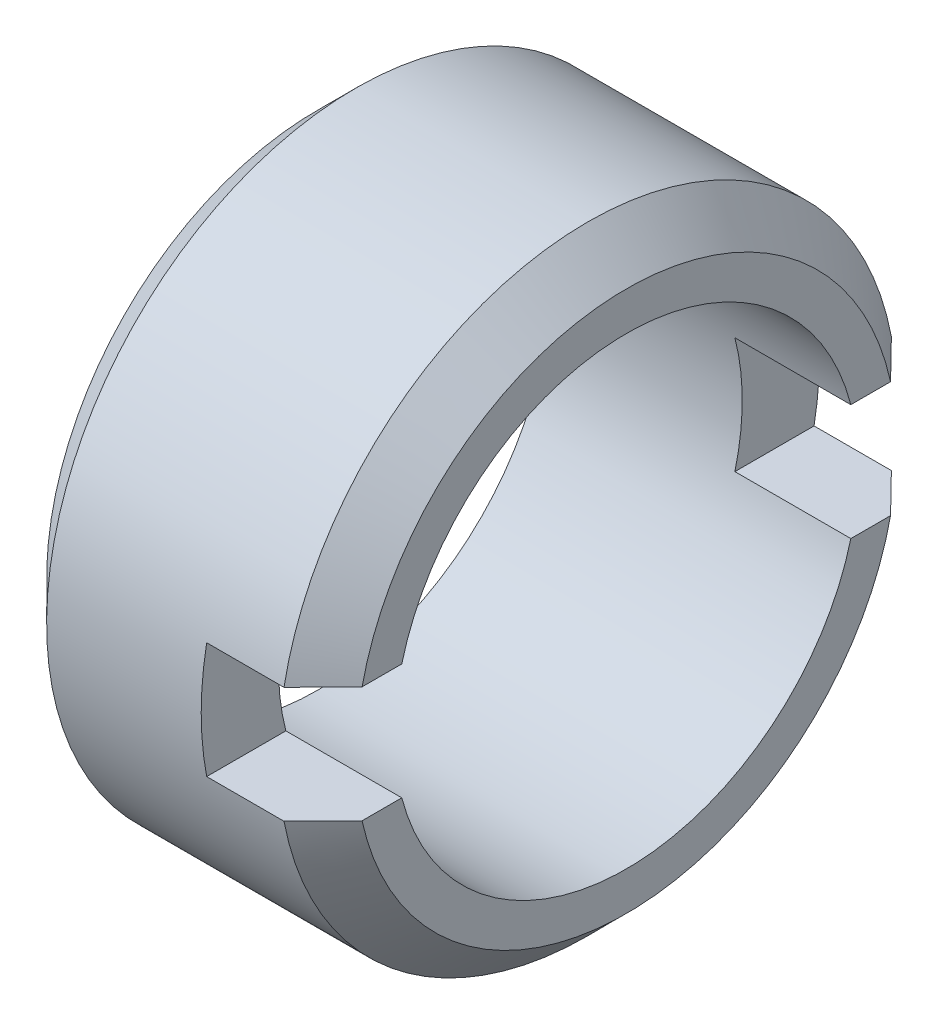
ISO-10303-21;
HEADER;
FILE_DESCRIPTION(('STEP AP214'),'2;1');
FILE_NAME('part.step','',(''),(''),'','','');
FILE_SCHEMA(('AUTOMOTIVE_DESIGN { 1 0 10303 214 1 1 1 1 }'));
ENDSEC;
DATA;
#1=APPLICATION_CONTEXT('core data for automotive mechanical design processes');
#2=APPLICATION_PROTOCOL_DEFINITION('international standard','automotive_design',2000,#1);
#3=PRODUCT_CONTEXT('',#1,'mechanical');
#4=PRODUCT('Part','Part','',(#3));
#5=PRODUCT_RELATED_PRODUCT_CATEGORY('part','',(#4));
#6=PRODUCT_DEFINITION_FORMATION('','',#4);
#7=PRODUCT_DEFINITION_CONTEXT('part definition',#1,'design');
#8=PRODUCT_DEFINITION('design','',#6,#7);
#9=PRODUCT_DEFINITION_SHAPE('','',#8);
#10=(LENGTH_UNIT() NAMED_UNIT(*) SI_UNIT(.MILLI.,.METRE.));
#11=(NAMED_UNIT(*) PLANE_ANGLE_UNIT() SI_UNIT($,.RADIAN.));
#12=(NAMED_UNIT(*) SI_UNIT($,.STERADIAN.) SOLID_ANGLE_UNIT());
#13=UNCERTAINTY_MEASURE_WITH_UNIT(LENGTH_MEASURE(1.E-05),#10,'distance_accuracy_value','');
#14=(GEOMETRIC_REPRESENTATION_CONTEXT(3) GLOBAL_UNCERTAINTY_ASSIGNED_CONTEXT((#13)) GLOBAL_UNIT_ASSIGNED_CONTEXT((#10,
#11,#12)) REPRESENTATION_CONTEXT('',''));
#15=CARTESIAN_POINT('',(0.,0.,0.));
#16=DIRECTION('',(0.,0.,1.));
#17=DIRECTION('',(1.,0.,0.));
#18=AXIS2_PLACEMENT_3D('',#15,#16,#17);
#19=CARTESIAN_POINT('',(8.,0.,0.));
#20=DIRECTION('',(1.,0.,0.));
#21=DIRECTION('',(0.,0.,-1.));
#22=AXIS2_PLACEMENT_3D('',#19,#20,#21);
#23=PLANE('',#22);
#24=CARTESIAN_POINT('',(8.,0.,0.));
#25=DIRECTION('',(1.,0.,0.));
#26=DIRECTION('',(0.,0.,-1.));
#27=AXIS2_PLACEMENT_3D('',#24,#25,#26);
#28=CIRCLE('',#27,7.);
#29=CARTESIAN_POINT('',(8.,1.5,-6.83739716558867));
#30=VERTEX_POINT('',#29);
#31=CARTESIAN_POINT('',(8.,1.5,6.83739716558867));
#32=VERTEX_POINT('',#31);
#33=EDGE_CURVE('E183',#30,#32,#28,.T.);
#34=ORIENTED_EDGE('',*,*,#33,.T.);
#35=DIRECTION('',(0.,0.,-1.));
#36=VECTOR('',#35,1.);
#37=CARTESIAN_POINT('',(8.,1.5,0.));
#38=LINE('',#37,#36);
#39=CARTESIAN_POINT('',(8.,1.5,5.80947501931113));
#40=VERTEX_POINT('',#39);
#41=EDGE_CURVE('E159',#32,#40,#38,.T.);
#42=ORIENTED_EDGE('',*,*,#41,.T.);
#43=CARTESIAN_POINT('',(8.,0.,0.));
#44=DIRECTION('',(1.,0.,0.));
#45=DIRECTION('',(0.,0.,-1.));
#46=AXIS2_PLACEMENT_3D('',#43,#44,#45);
#47=CIRCLE('',#46,6.);
#48=CARTESIAN_POINT('',(8.,1.5,-5.80947501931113));
#49=VERTEX_POINT('',#48);
#50=EDGE_CURVE('E167',#49,#40,#47,.T.);
#51=ORIENTED_EDGE('',*,*,#50,.F.);
#52=EDGE_CURVE('E155',#49,#30,#38,.T.);
#53=ORIENTED_EDGE('',*,*,#52,.T.);
#54=EDGE_LOOP('',(#34,#42,#51,#53));
#55=FACE_BOUND('',#54,.T.);
#56=ADVANCED_FACE('F37',(#55),#23,.T.);
#57=CARTESIAN_POINT('',(8.,-1.5,6.83739716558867));
#58=VERTEX_POINT('',#57);
#59=CARTESIAN_POINT('',(8.,-1.5,-6.83739716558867));
#60=VERTEX_POINT('',#59);
#61=EDGE_CURVE('E182',#58,#60,#28,.T.);
#62=ORIENTED_EDGE('',*,*,#61,.T.);
#63=DIRECTION('',(0.,0.,1.));
#64=VECTOR('',#63,1.);
#65=CARTESIAN_POINT('',(8.,-1.5,0.));
#66=LINE('',#65,#64);
#67=CARTESIAN_POINT('',(8.,-1.5,-5.80947501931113));
#68=VERTEX_POINT('',#67);
#69=EDGE_CURVE('E53',#60,#68,#66,.T.);
#70=ORIENTED_EDGE('',*,*,#69,.T.);
#71=CARTESIAN_POINT('',(8.,-1.5,5.80947501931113));
#72=VERTEX_POINT('',#71);
#73=EDGE_CURVE('E171',#72,#68,#47,.T.);
#74=ORIENTED_EDGE('',*,*,#73,.F.);
#75=EDGE_CURVE('E140',#72,#58,#66,.T.);
#76=ORIENTED_EDGE('',*,*,#75,.T.);
#77=EDGE_LOOP('',(#62,#70,#74,#76));
#78=FACE_BOUND('',#77,.T.);
#79=ADVANCED_FACE('F216',(#78),#23,.T.);
#80=CARTESIAN_POINT('',(8.,0.,0.));
#81=DIRECTION('',(-1.,0.,0.));
#82=DIRECTION('',(0.,0.,1.));
#83=AXIS2_PLACEMENT_3D('',#80,#81,#82);
#84=CYLINDRICAL_SURFACE('',#83,8.);
#85=CARTESIAN_POINT('',(1.,0.,0.));
#86=DIRECTION('',(1.,0.,0.));
#87=DIRECTION('',(0.,0.,-1.));
#88=AXIS2_PLACEMENT_3D('',#85,#86,#87);
#89=CIRCLE('',#88,8.);
#90=CARTESIAN_POINT('',(1.,0.,-8.));
#91=VERTEX_POINT('',#90);
#92=EDGE_CURVE('E176',#91,#91,#89,.T.);
#93=ORIENTED_EDGE('',*,*,#92,.T.);
#94=EDGE_LOOP('',(#93));
#95=FACE_BOUND('',#94,.T.);
#96=DIRECTION('',(-1.,0.,0.));
#97=VECTOR('',#96,1.);
#98=CARTESIAN_POINT('',(8.,1.5,-7.85811682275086));
#99=LINE('',#98,#97);
#100=CARTESIAN_POINT('',(5.,1.5,-7.85811682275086));
#101=VERTEX_POINT('',#100);
#102=CARTESIAN_POINT('',(7.,1.5,-7.85811682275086));
#103=VERTEX_POINT('',#102);
#104=EDGE_CURVE('E153',#101,#103,#99,.F.);
#105=ORIENTED_EDGE('',*,*,#104,.F.);
#106=CARTESIAN_POINT('',(5.,0.,0.));
#107=DIRECTION('',(1.,0.,0.));
#108=DIRECTION('',(0.,0.,-1.));
#109=AXIS2_PLACEMENT_3D('',#106,#107,#108);
#110=CIRCLE('',#109,8.);
#111=CARTESIAN_POINT('',(5.,-1.5,-7.85811682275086));
#112=VERTEX_POINT('',#111);
#113=EDGE_CURVE('E126',#112,#101,#110,.T.);
#114=ORIENTED_EDGE('',*,*,#113,.F.);
#115=DIRECTION('',(-1.,0.,0.));
#116=VECTOR('',#115,1.);
#117=CARTESIAN_POINT('',(8.,-1.5,-7.85811682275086));
#118=LINE('',#117,#116);
#119=CARTESIAN_POINT('',(7.,-1.5,-7.85811682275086));
#120=VERTEX_POINT('',#119);
#121=EDGE_CURVE('E147',#120,#112,#118,.T.);
#122=ORIENTED_EDGE('',*,*,#121,.F.);
#123=CARTESIAN_POINT('',(7.,0.,0.));
#124=DIRECTION('',(1.,0.,0.));
#125=DIRECTION('',(0.,0.,-1.));
#126=AXIS2_PLACEMENT_3D('',#123,#124,#125);
#127=CIRCLE('',#126,8.);
#128=CARTESIAN_POINT('',(7.,-1.5,7.85811682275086));
#129=VERTEX_POINT('',#128);
#130=EDGE_CURVE('E139',#120,#129,#127,.F.);
#131=ORIENTED_EDGE('',*,*,#130,.T.);
#132=DIRECTION('',(-1.,0.,0.));
#133=VECTOR('',#132,1.);
#134=CARTESIAN_POINT('',(8.,-1.5,7.85811682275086));
#135=LINE('',#134,#133);
#136=CARTESIAN_POINT('',(5.,-1.5,7.85811682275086));
#137=VERTEX_POINT('',#136);
#138=EDGE_CURVE('E61',#137,#129,#135,.F.);
#139=ORIENTED_EDGE('',*,*,#138,.F.);
#140=CARTESIAN_POINT('',(5.,1.5,7.85811682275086));
#141=VERTEX_POINT('',#140);
#142=EDGE_CURVE('E117',#141,#137,#110,.T.);
#143=ORIENTED_EDGE('',*,*,#142,.F.);
#144=DIRECTION('',(-1.,0.,0.));
#145=VECTOR('',#144,1.);
#146=CARTESIAN_POINT('',(8.,1.5,7.85811682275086));
#147=LINE('',#146,#145);
#148=CARTESIAN_POINT('',(7.,1.5,7.85811682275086));
#149=VERTEX_POINT('',#148);
#150=EDGE_CURVE('E162',#149,#141,#147,.T.);
#151=ORIENTED_EDGE('',*,*,#150,.F.);
#152=EDGE_CURVE('E170',#149,#103,#127,.F.);
#153=ORIENTED_EDGE('',*,*,#152,.T.);
#154=EDGE_LOOP('',(#105,#114,#122,#131,#139,#143,#151,#153));
#155=FACE_BOUND('',#154,.T.);
#156=ADVANCED_FACE('F136',(#95,#155),#84,.T.);
#157=CARTESIAN_POINT('',(8.,0.,0.));
#158=DIRECTION('',(-1.,0.,0.));
#159=DIRECTION('',(0.,0.,1.));
#160=AXIS2_PLACEMENT_3D('',#157,#158,#159);
#161=CYLINDRICAL_SURFACE('',#160,6.);
#162=CARTESIAN_POINT('',(0.,0.,0.));
#163=DIRECTION('',(1.,0.,0.));
#164=DIRECTION('',(0.,0.,-1.));
#165=AXIS2_PLACEMENT_3D('',#162,#163,#164);
#166=CIRCLE('',#165,6.);
#167=CARTESIAN_POINT('',(0.,0.,-6.));
#168=VERTEX_POINT('',#167);
#169=EDGE_CURVE('E125',#168,#168,#166,.T.);
#170=ORIENTED_EDGE('',*,*,#169,.F.);
#171=EDGE_LOOP('',(#170));
#172=FACE_BOUND('',#171,.T.);
#173=CARTESIAN_POINT('',(5.,0.,0.));
#174=DIRECTION('',(1.,0.,0.));
#175=DIRECTION('',(0.,0.,-1.));
#176=AXIS2_PLACEMENT_3D('',#173,#174,#175);
#177=CIRCLE('',#176,6.);
#178=CARTESIAN_POINT('',(5.,-1.5,-5.80947501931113));
#179=VERTEX_POINT('',#178);
#180=CARTESIAN_POINT('',(5.,1.5,-5.80947501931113));
#181=VERTEX_POINT('',#180);
#182=EDGE_CURVE('E12',#179,#181,#177,.T.);
#183=ORIENTED_EDGE('',*,*,#182,.T.);
#184=DIRECTION('',(-1.,0.,0.));
#185=VECTOR('',#184,1.);
#186=CARTESIAN_POINT('',(8.,1.5,-5.80947501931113));
#187=LINE('',#186,#185);
#188=EDGE_CURVE('E158',#181,#49,#187,.F.);
#189=ORIENTED_EDGE('',*,*,#188,.T.);
#190=ORIENTED_EDGE('',*,*,#50,.T.);
#191=DIRECTION('',(-1.,0.,0.));
#192=VECTOR('',#191,1.);
#193=CARTESIAN_POINT('',(8.,1.5,5.80947501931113));
#194=LINE('',#193,#192);
#195=CARTESIAN_POINT('',(5.,1.5,5.80947501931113));
#196=VERTEX_POINT('',#195);
#197=EDGE_CURVE('E164',#40,#196,#194,.T.);
#198=ORIENTED_EDGE('',*,*,#197,.T.);
#199=CARTESIAN_POINT('',(5.,-1.5,5.80947501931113));
#200=VERTEX_POINT('',#199);
#201=EDGE_CURVE('E42',#196,#200,#177,.T.);
#202=ORIENTED_EDGE('',*,*,#201,.T.);
#203=DIRECTION('',(-1.,0.,0.));
#204=VECTOR('',#203,1.);
#205=CARTESIAN_POINT('',(8.,-1.5,5.80947501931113));
#206=LINE('',#205,#204);
#207=EDGE_CURVE('E130',#200,#72,#206,.F.);
#208=ORIENTED_EDGE('',*,*,#207,.T.);
#209=ORIENTED_EDGE('',*,*,#73,.T.);
#210=DIRECTION('',(-1.,0.,0.));
#211=VECTOR('',#210,1.);
#212=CARTESIAN_POINT('',(8.,-1.5,-5.80947501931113));
#213=LINE('',#212,#211);
#214=EDGE_CURVE('E150',#68,#179,#213,.T.);
#215=ORIENTED_EDGE('',*,*,#214,.T.);
#216=EDGE_LOOP('',(#183,#189,#190,#198,#202,#208,#209,#215));
#217=FACE_BOUND('',#216,.T.);
#218=ADVANCED_FACE('F210',(#172,#217),#161,.F.);
#219=CARTESIAN_POINT('',(8.,0.,0.));
#220=DIRECTION('',(-1.,0.,0.));
#221=DIRECTION('',(0.,0.,1.));
#222=AXIS2_PLACEMENT_3D('',#219,#220,#221);
#223=CONICAL_SURFACE('',#222,7.,0.785398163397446);
#224=ORIENTED_EDGE('',*,*,#152,.F.);
#225=CARTESIAN_POINT('',(-2.61893172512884,1.5,17.5549638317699));
#226=CARTESIAN_POINT('',(-1.99362074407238,1.5,16.9273536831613));
#227=CARTESIAN_POINT('',(-1.3684122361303,1.5,16.2996413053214));
#228=CARTESIAN_POINT('',(-0.118306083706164,1.5,15.0438337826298));
#229=CARTESIAN_POINT('',(0.506591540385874,1.5,14.4157386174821));
#230=CARTESIAN_POINT('',(1.75677601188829,1.5,13.1581762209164));
#231=CARTESIAN_POINT('',(2.3820621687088,1.5,12.5287083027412));
#232=CARTESIAN_POINT('',(3.631832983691,1.5,11.2690484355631));
#233=CARTESIAN_POINT('',(4.25631768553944,1.5,10.6388565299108));
#234=CARTESIAN_POINT('',(5.46666104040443,1.5,9.41501098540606));
#235=CARTESIAN_POINT('',(6.0525928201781,1.5,8.82142974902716));
#236=CARTESIAN_POINT('',(6.93002699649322,1.5,7.929516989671));
#237=CARTESIAN_POINT('',(7.22228623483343,1.5,7.63193023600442));
#238=CARTESIAN_POINT('',(7.8060801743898,1.5,7.03605573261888));
#239=CARTESIAN_POINT('',(8.09761488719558,1.5,6.73776799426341));
#240=CARTESIAN_POINT('',(8.67938833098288,1.5,6.14041681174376));
#241=CARTESIAN_POINT('',(8.96962794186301,1.5,5.84135422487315));
#242=CARTESIAN_POINT('',(9.54851548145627,1.5,5.24165215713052));
#243=CARTESIAN_POINT('',(9.83716330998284,1.5,4.94101257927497));
#244=CARTESIAN_POINT('',(10.2680474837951,1.5,4.48814971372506));
#245=CARTESIAN_POINT('',(10.4113068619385,1.5,4.33690038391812));
#246=CARTESIAN_POINT('',(10.6968959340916,1.5,4.03352717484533));
#247=CARTESIAN_POINT('',(10.8392256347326,1.5,3.88140330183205));
#248=CARTESIAN_POINT('',(11.1225839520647,1.5,3.57597593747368));
#249=CARTESIAN_POINT('',(11.2636126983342,1.5,3.42267256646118));
#250=CARTESIAN_POINT('',(11.5438156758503,1.5,3.1143823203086));
#251=CARTESIAN_POINT('',(11.6829899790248,1.5,2.95939551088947));
#252=CARTESIAN_POINT('',(11.8592298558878,1.5,2.7595022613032));
#253=CARTESIAN_POINT('',(11.8976064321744,1.5,2.7157513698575));
#254=CARTESIAN_POINT('',(11.9741029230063,1.5,2.62802503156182));
#255=CARTESIAN_POINT('',(12.0122228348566,1.5,2.58404958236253));
#256=CARTESIAN_POINT('',(12.1261525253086,1.5,2.4517375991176));
#257=CARTESIAN_POINT('',(12.2015252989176,1.5,2.36302329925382));
#258=CARTESIAN_POINT('',(12.3514863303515,1.5,2.18336896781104));
#259=CARTESIAN_POINT('',(12.426058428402,1.5,2.09241540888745));
#260=CARTESIAN_POINT('',(12.5729942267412,1.5,1.90876870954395));
#261=CARTESIAN_POINT('',(12.6453584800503,1.5,1.81607601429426));
#262=CARTESIAN_POINT('',(12.7877577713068,1.5,1.6272403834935));
#263=CARTESIAN_POINT('',(12.8577568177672,1.5,1.53107015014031));
#264=CARTESIAN_POINT('',(12.9930643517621,1.5,1.33523148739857));
#265=CARTESIAN_POINT('',(13.0583665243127,1.5,1.23555860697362));
#266=CARTESIAN_POINT('',(13.1502815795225,1.5,1.08307902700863));
#267=CARTESIAN_POINT('',(13.1797784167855,1.5,1.03202487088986));
#268=CARTESIAN_POINT('',(13.2363606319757,1.5,0.928602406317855));
#269=CARTESIAN_POINT('',(13.2634455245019,1.5,0.876233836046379));
#270=CARTESIAN_POINT('',(13.3399905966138,1.5,0.717128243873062));
#271=CARTESIAN_POINT('',(13.384962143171,1.5,0.60804173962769));
#272=CARTESIAN_POINT('',(13.4362386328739,1.5,0.444639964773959));
#273=CARTESIAN_POINT('',(13.4502799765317,1.5,0.392746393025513));
#274=CARTESIAN_POINT('',(13.4734842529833,1.5,0.287861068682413));
#275=CARTESIAN_POINT('',(13.4826479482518,1.5,0.234869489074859));
#276=CARTESIAN_POINT('',(13.495427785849,1.5,0.128484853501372));
#277=CARTESIAN_POINT('',(13.4990721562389,1.5,0.075095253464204));
#278=CARTESIAN_POINT('',(13.5006150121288,1.5,-0.0317698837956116));
#279=CARTESIAN_POINT('',(13.4985134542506,1.5,-0.0852454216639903));
#280=CARTESIAN_POINT('',(13.4887554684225,1.5,-0.191428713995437));
#281=CARTESIAN_POINT('',(13.4811244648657,1.5,-0.244138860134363));
#282=CARTESIAN_POINT('',(13.4608799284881,1.5,-0.348598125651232));
#283=CARTESIAN_POINT('',(13.4482641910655,1.5,-0.400346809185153));
#284=CARTESIAN_POINT('',(13.4186934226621,1.5,-0.502955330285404));
#285=CARTESIAN_POINT('',(13.401709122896,1.5,-0.553806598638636));
#286=CARTESIAN_POINT('',(13.3642222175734,1.5,-0.654166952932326));
#287=CARTESIAN_POINT('',(13.3437201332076,1.5,-0.703676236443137));
#288=CARTESIAN_POINT('',(13.2835957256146,1.5,-0.837774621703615));
#289=CARTESIAN_POINT('',(13.2410939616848,1.5,-0.921066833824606));
#290=CARTESIAN_POINT('',(13.150289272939,1.5,-1.08445428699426));
#291=CARTESIAN_POINT('',(13.1019800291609,1.5,-1.16454591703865));
#292=CARTESIAN_POINT('',(13.0012022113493,1.5,-1.32245803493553));
#293=CARTESIAN_POINT('',(12.9487190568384,1.5,-1.40026913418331));
#294=CARTESIAN_POINT('',(12.8409516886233,1.5,-1.55385889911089));
#295=CARTESIAN_POINT('',(12.7856686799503,1.5,-1.6296384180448));
#296=CARTESIAN_POINT('',(12.6725203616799,1.5,-1.78035380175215));
#297=CARTESIAN_POINT('',(12.6146356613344,1.5,-1.85527503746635));
#298=CARTESIAN_POINT('',(12.4973028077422,1.5,-2.00388880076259));
#299=CARTESIAN_POINT('',(12.4378545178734,1.5,-2.07758122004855));
#300=CARTESIAN_POINT('',(12.3179091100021,1.5,-2.22381566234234));
#301=CARTESIAN_POINT('',(12.2574147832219,1.5,-2.29635998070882));
#302=CARTESIAN_POINT('',(12.1355026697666,1.5,-2.4406617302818));
#303=CARTESIAN_POINT('',(12.0740849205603,1.5,-2.51241919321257));
#304=CARTESIAN_POINT('',(11.8913963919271,1.5,-2.7236694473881));
#305=CARTESIAN_POINT('',(11.7690932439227,1.5,-2.86226884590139));
#306=CARTESIAN_POINT('',(11.5226315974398,1.5,-3.13781078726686));
#307=CARTESIAN_POINT('',(11.398473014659,1.5,-3.27475325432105));
#308=CARTESIAN_POINT('',(11.1488351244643,1.5,-3.54746163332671));
#309=CARTESIAN_POINT('',(11.0233556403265,1.5,-3.68322738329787));
#310=CARTESIAN_POINT('',(10.7714444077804,1.5,-3.95387326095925));
#311=CARTESIAN_POINT('',(10.6450126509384,1.5,-4.08875338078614));
#312=CARTESIAN_POINT('',(10.2643618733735,1.5,-4.49271440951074));
#313=CARTESIAN_POINT('',(10.0090828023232,1.5,-4.76079577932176));
#314=CARTESIAN_POINT('',(9.49685589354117,1.5,-5.29531294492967));
#315=CARTESIAN_POINT('',(9.23990819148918,1.5,-5.56174887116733));
#316=CARTESIAN_POINT('',(8.72725848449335,1.5,-6.09110821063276));
#317=CARTESIAN_POINT('',(8.4715666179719,1.5,-6.35404144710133));
#318=CARTESIAN_POINT('',(7.959422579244,1.5,-6.87917638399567));
#319=CARTESIAN_POINT('',(7.70297039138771,1.5,-7.14137806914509));
#320=CARTESIAN_POINT('',(6.93304903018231,1.5,-7.92695755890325));
#321=CARTESIAN_POINT('',(6.4187801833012,1.5,-8.44955141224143));
#322=CARTESIAN_POINT('',(5.55185522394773,1.5,-9.32849249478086));
#323=CARTESIAN_POINT('',(5.19951746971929,1.5,-9.68515423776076));
#324=CARTESIAN_POINT('',(4.49442755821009,1.5,-10.3980693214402));
#325=CARTESIAN_POINT('',(4.14167540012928,1.5,-10.7543226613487));
#326=CARTESIAN_POINT('',(3.0828518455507,1.5,-11.8227561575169));
#327=CARTESIAN_POINT('',(2.37633094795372,1.5,-12.5344907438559));
#328=CARTESIAN_POINT('',(0.955225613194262,1.5,-13.9646767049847));
#329=CARTESIAN_POINT('',(0.240633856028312,1.5,-14.683120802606));
#330=CARTESIAN_POINT('',(-1.18890769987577,1.5,-16.1194059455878));
#331=CARTESIAN_POINT('',(-1.90385741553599,1.5,-16.8372470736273));
#332=CARTESIAN_POINT('',(-2.61893172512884,1.5,-17.5549638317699));
#333=B_SPLINE_CURVE_WITH_KNOTS('',3,(#225,#226,#227,#228,#229,#230,#231,#232,#233,#234,#235,
#236,#237,#238,#239,#240,#241,#242,#243,#244,#245,#246,#247,#248,#249,#250,#251,#252,#253,#254,
#255,#256,#257,#258,#259,#260,#261,#262,#263,#264,#265,#266,#267,#268,#269,#270,#271,#272,#273,
#274,#275,#276,#277,#278,#279,#280,#281,#282,#283,#284,#285,#286,#287,#288,#289,#290,#291,#292,
#293,#294,#295,#296,#297,#298,#299,#300,#301,#302,#303,#304,#305,#306,#307,#308,#309,#310,#311,
#312,#313,#314,#315,#316,#317,#318,#319,#320,#321,#322,#323,#324,#325,#326,#327,#328,#329,#330,
#331,#332),.UNSPECIFIED.,.F.,.F.,(4,2,2,2,2,2,2,2,2,2,2,2,2,2,2,2,2,2,2,2,2,2,2,2,2,2,2,2,2,2,2,
2,2,2,2,2,2,2,2,2,2,2,2,2,2,2,2,2,2,2,2,2,2,4),(0.,2.65785167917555,5.31585929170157,
7.9776089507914,10.6392067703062,13.1413810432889,14.3926836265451,15.6439660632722,
16.8942021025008,18.1445159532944,18.7694905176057,19.3944606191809,20.0193677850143,
20.6442506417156,20.8188410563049,20.9934333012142,21.3426493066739,21.695474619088,
22.0482108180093,22.4049712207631,22.7622026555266,22.9390263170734,23.1158854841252,
23.4683672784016,23.6294601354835,23.7905278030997,23.9507688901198,24.1110111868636,
24.2705213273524,24.4301020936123,24.5907812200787,24.7514365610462,25.0315824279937,
25.3120359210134,25.593516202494,25.8748763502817,26.1588816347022,26.4429118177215,
26.7262749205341,27.0096265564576,27.5641339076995,28.118666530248,28.6732743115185,
29.2278870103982,30.3384194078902,31.4488626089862,32.549137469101,33.6494351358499,
35.8490195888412,37.3530624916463,38.8571083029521,41.8657018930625,44.9056407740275,
47.945055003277),.UNSPECIFIED.);
#334=EDGE_CURVE('E247',#149,#32,#333,.T.);
#335=ORIENTED_EDGE('',*,*,#334,.T.);
#336=ORIENTED_EDGE('',*,*,#33,.F.);
#337=EDGE_CURVE('E192',#30,#103,#333,.T.);
#338=ORIENTED_EDGE('',*,*,#337,.T.);
#339=EDGE_LOOP('',(#224,#335,#336,#338));
#340=FACE_BOUND('',#339,.T.);
#341=ADVANCED_FACE('F39',(#340),#223,.T.);
#342=ORIENTED_EDGE('',*,*,#130,.F.);
#343=CARTESIAN_POINT('',(-2.61893172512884,-1.5,-17.5549638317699));
#344=CARTESIAN_POINT('',(-1.99362074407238,-1.5,-16.9273536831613));
#345=CARTESIAN_POINT('',(-1.3684122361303,-1.5,-16.2996413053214));
#346=CARTESIAN_POINT('',(-0.118306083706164,-1.5,-15.0438337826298));
#347=CARTESIAN_POINT('',(0.506591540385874,-1.5,-14.4157386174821));
#348=CARTESIAN_POINT('',(1.75677601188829,-1.5,-13.1581762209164));
#349=CARTESIAN_POINT('',(2.3820621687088,-1.5,-12.5287083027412));
#350=CARTESIAN_POINT('',(3.631832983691,-1.5,-11.2690484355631));
#351=CARTESIAN_POINT('',(4.25631768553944,-1.5,-10.6388565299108));
#352=CARTESIAN_POINT('',(5.46666104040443,-1.5,-9.41501098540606));
#353=CARTESIAN_POINT('',(6.0525928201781,-1.5,-8.82142974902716));
#354=CARTESIAN_POINT('',(6.93002699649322,-1.5,-7.929516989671));
#355=CARTESIAN_POINT('',(7.22228623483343,-1.5,-7.63193023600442));
#356=CARTESIAN_POINT('',(7.8060801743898,-1.5,-7.03605573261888));
#357=CARTESIAN_POINT('',(8.09761488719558,-1.5,-6.73776799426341));
#358=CARTESIAN_POINT('',(8.67938833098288,-1.5,-6.14041681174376));
#359=CARTESIAN_POINT('',(8.96962794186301,-1.5,-5.84135422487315));
#360=CARTESIAN_POINT('',(9.54851548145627,-1.5,-5.24165215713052));
#361=CARTESIAN_POINT('',(9.83716330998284,-1.5,-4.94101257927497));
#362=CARTESIAN_POINT('',(10.2680474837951,-1.5,-4.48814971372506));
#363=CARTESIAN_POINT('',(10.4113068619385,-1.5,-4.33690038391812));
#364=CARTESIAN_POINT('',(10.6968959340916,-1.5,-4.03352717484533));
#365=CARTESIAN_POINT('',(10.8392256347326,-1.5,-3.88140330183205));
#366=CARTESIAN_POINT('',(11.1225839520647,-1.5,-3.57597593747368));
#367=CARTESIAN_POINT('',(11.2636126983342,-1.5,-3.42267256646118));
#368=CARTESIAN_POINT('',(11.5438156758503,-1.5,-3.1143823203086));
#369=CARTESIAN_POINT('',(11.6829899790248,-1.5,-2.95939551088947));
#370=CARTESIAN_POINT('',(11.8592298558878,-1.5,-2.7595022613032));
#371=CARTESIAN_POINT('',(11.8976064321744,-1.5,-2.7157513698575));
#372=CARTESIAN_POINT('',(11.9741029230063,-1.5,-2.62802503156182));
#373=CARTESIAN_POINT('',(12.0122228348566,-1.5,-2.58404958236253));
#374=CARTESIAN_POINT('',(12.1261525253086,-1.5,-2.4517375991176));
#375=CARTESIAN_POINT('',(12.2015252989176,-1.5,-2.36302329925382));
#376=CARTESIAN_POINT('',(12.3514863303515,-1.5,-2.18336896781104));
#377=CARTESIAN_POINT('',(12.426058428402,-1.5,-2.09241540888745));
#378=CARTESIAN_POINT('',(12.5729942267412,-1.5,-1.90876870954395));
#379=CARTESIAN_POINT('',(12.6453584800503,-1.5,-1.81607601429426));
#380=CARTESIAN_POINT('',(12.7877577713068,-1.5,-1.6272403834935));
#381=CARTESIAN_POINT('',(12.8577568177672,-1.5,-1.53107015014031));
#382=CARTESIAN_POINT('',(12.9930643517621,-1.5,-1.33523148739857));
#383=CARTESIAN_POINT('',(13.0583665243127,-1.5,-1.23555860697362));
#384=CARTESIAN_POINT('',(13.1502815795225,-1.5,-1.08307902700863));
#385=CARTESIAN_POINT('',(13.1797784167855,-1.5,-1.03202487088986));
#386=CARTESIAN_POINT('',(13.2363606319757,-1.5,-0.928602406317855));
#387=CARTESIAN_POINT('',(13.2634455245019,-1.5,-0.876233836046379));
#388=CARTESIAN_POINT('',(13.3399905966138,-1.5,-0.717128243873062));
#389=CARTESIAN_POINT('',(13.384962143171,-1.5,-0.60804173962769));
#390=CARTESIAN_POINT('',(13.4362386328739,-1.5,-0.444639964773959));
#391=CARTESIAN_POINT('',(13.4502799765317,-1.5,-0.392746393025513));
#392=CARTESIAN_POINT('',(13.4734842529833,-1.5,-0.287861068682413));
#393=CARTESIAN_POINT('',(13.4826479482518,-1.5,-0.234869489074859));
#394=CARTESIAN_POINT('',(13.495427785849,-1.5,-0.128484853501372));
#395=CARTESIAN_POINT('',(13.4990721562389,-1.5,-0.075095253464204));
#396=CARTESIAN_POINT('',(13.5006150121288,-1.5,0.0317698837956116));
#397=CARTESIAN_POINT('',(13.4985134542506,-1.5,0.0852454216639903));
#398=CARTESIAN_POINT('',(13.4887554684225,-1.5,0.191428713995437));
#399=CARTESIAN_POINT('',(13.4811244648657,-1.5,0.244138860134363));
#400=CARTESIAN_POINT('',(13.4608799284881,-1.5,0.348598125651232));
#401=CARTESIAN_POINT('',(13.4482641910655,-1.5,0.400346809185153));
#402=CARTESIAN_POINT('',(13.4186934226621,-1.5,0.502955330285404));
#403=CARTESIAN_POINT('',(13.401709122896,-1.5,0.553806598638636));
#404=CARTESIAN_POINT('',(13.3642222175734,-1.5,0.654166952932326));
#405=CARTESIAN_POINT('',(13.3437201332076,-1.5,0.703676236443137));
#406=CARTESIAN_POINT('',(13.2835957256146,-1.5,0.837774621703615));
#407=CARTESIAN_POINT('',(13.2410939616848,-1.5,0.921066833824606));
#408=CARTESIAN_POINT('',(13.150289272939,-1.5,1.08445428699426));
#409=CARTESIAN_POINT('',(13.1019800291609,-1.5,1.16454591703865));
#410=CARTESIAN_POINT('',(13.0012022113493,-1.5,1.32245803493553));
#411=CARTESIAN_POINT('',(12.9487190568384,-1.5,1.40026913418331));
#412=CARTESIAN_POINT('',(12.8409516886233,-1.5,1.55385889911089));
#413=CARTESIAN_POINT('',(12.7856686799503,-1.5,1.6296384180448));
#414=CARTESIAN_POINT('',(12.6725203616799,-1.5,1.78035380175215));
#415=CARTESIAN_POINT('',(12.6146356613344,-1.5,1.85527503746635));
#416=CARTESIAN_POINT('',(12.4973028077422,-1.5,2.00388880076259));
#417=CARTESIAN_POINT('',(12.4378545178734,-1.5,2.07758122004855));
#418=CARTESIAN_POINT('',(12.3179091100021,-1.5,2.22381566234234));
#419=CARTESIAN_POINT('',(12.2574147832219,-1.5,2.29635998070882));
#420=CARTESIAN_POINT('',(12.1355026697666,-1.5,2.4406617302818));
#421=CARTESIAN_POINT('',(12.0740849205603,-1.5,2.51241919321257));
#422=CARTESIAN_POINT('',(11.8913963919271,-1.5,2.7236694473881));
#423=CARTESIAN_POINT('',(11.7690932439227,-1.5,2.86226884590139));
#424=CARTESIAN_POINT('',(11.5226315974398,-1.5,3.13781078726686));
#425=CARTESIAN_POINT('',(11.398473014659,-1.5,3.27475325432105));
#426=CARTESIAN_POINT('',(11.1488351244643,-1.5,3.54746163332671));
#427=CARTESIAN_POINT('',(11.0233556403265,-1.5,3.68322738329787));
#428=CARTESIAN_POINT('',(10.7714444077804,-1.5,3.95387326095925));
#429=CARTESIAN_POINT('',(10.6450126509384,-1.5,4.08875338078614));
#430=CARTESIAN_POINT('',(10.2643618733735,-1.5,4.49271440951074));
#431=CARTESIAN_POINT('',(10.0090828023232,-1.5,4.76079577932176));
#432=CARTESIAN_POINT('',(9.49685589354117,-1.5,5.29531294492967));
#433=CARTESIAN_POINT('',(9.23990819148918,-1.5,5.56174887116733));
#434=CARTESIAN_POINT('',(8.72725848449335,-1.5,6.09110821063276));
#435=CARTESIAN_POINT('',(8.4715666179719,-1.5,6.35404144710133));
#436=CARTESIAN_POINT('',(7.959422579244,-1.5,6.87917638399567));
#437=CARTESIAN_POINT('',(7.70297039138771,-1.5,7.14137806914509));
#438=CARTESIAN_POINT('',(6.93304903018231,-1.5,7.92695755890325));
#439=CARTESIAN_POINT('',(6.4187801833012,-1.5,8.44955141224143));
#440=CARTESIAN_POINT('',(5.55185522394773,-1.5,9.32849249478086));
#441=CARTESIAN_POINT('',(5.19951746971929,-1.5,9.68515423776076));
#442=CARTESIAN_POINT('',(4.49442755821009,-1.5,10.3980693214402));
#443=CARTESIAN_POINT('',(4.14167540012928,-1.5,10.7543226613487));
#444=CARTESIAN_POINT('',(3.0828518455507,-1.5,11.8227561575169));
#445=CARTESIAN_POINT('',(2.37633094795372,-1.5,12.5344907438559));
#446=CARTESIAN_POINT('',(0.955225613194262,-1.5,13.9646767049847));
#447=CARTESIAN_POINT('',(0.240633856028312,-1.5,14.683120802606));
#448=CARTESIAN_POINT('',(-1.18890769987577,-1.5,16.1194059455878));
#449=CARTESIAN_POINT('',(-1.90385741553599,-1.5,16.8372470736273));
#450=CARTESIAN_POINT('',(-2.61893172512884,-1.5,17.5549638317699));
#451=B_SPLINE_CURVE_WITH_KNOTS('',3,(#343,#344,#345,#346,#347,#348,#349,#350,#351,#352,#353,
#354,#355,#356,#357,#358,#359,#360,#361,#362,#363,#364,#365,#366,#367,#368,#369,#370,#371,#372,
#373,#374,#375,#376,#377,#378,#379,#380,#381,#382,#383,#384,#385,#386,#387,#388,#389,#390,#391,
#392,#393,#394,#395,#396,#397,#398,#399,#400,#401,#402,#403,#404,#405,#406,#407,#408,#409,#410,
#411,#412,#413,#414,#415,#416,#417,#418,#419,#420,#421,#422,#423,#424,#425,#426,#427,#428,#429,
#430,#431,#432,#433,#434,#435,#436,#437,#438,#439,#440,#441,#442,#443,#444,#445,#446,#447,#448,
#449,#450),.UNSPECIFIED.,.F.,.F.,(4,2,2,2,2,2,2,2,2,2,2,2,2,2,2,2,2,2,2,2,2,2,2,2,2,2,2,2,2,2,2,
2,2,2,2,2,2,2,2,2,2,2,2,2,2,2,2,2,2,2,2,2,2,4),(0.,2.65785167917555,5.31585929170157,
7.9776089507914,10.6392067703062,13.1413810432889,14.3926836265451,15.6439660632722,
16.8942021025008,18.1445159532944,18.7694905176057,19.3944606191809,20.0193677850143,
20.6442506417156,20.8188410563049,20.9934333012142,21.3426493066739,21.695474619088,
22.0482108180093,22.4049712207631,22.7622026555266,22.9390263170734,23.1158854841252,
23.4683672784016,23.6294601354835,23.7905278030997,23.9507688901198,24.1110111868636,
24.2705213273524,24.4301020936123,24.5907812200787,24.7514365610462,25.0315824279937,
25.3120359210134,25.593516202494,25.8748763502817,26.1588816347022,26.4429118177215,
26.7262749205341,27.0096265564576,27.5641339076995,28.118666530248,28.6732743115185,
29.2278870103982,30.3384194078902,31.4488626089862,32.549137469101,33.6494351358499,
35.8490195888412,37.3530624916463,38.8571083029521,41.8657018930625,44.9056407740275,
47.945055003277),.UNSPECIFIED.);
#452=EDGE_CURVE('E191',#120,#60,#451,.T.);
#453=ORIENTED_EDGE('',*,*,#452,.T.);
#454=ORIENTED_EDGE('',*,*,#61,.F.);
#455=EDGE_CURVE('E186',#58,#129,#451,.T.);
#456=ORIENTED_EDGE('',*,*,#455,.T.);
#457=EDGE_LOOP('',(#342,#453,#454,#456));
#458=FACE_BOUND('',#457,.T.);
#459=ADVANCED_FACE('F221',(#458),#223,.T.);
#460=CARTESIAN_POINT('',(0.,0.,0.));
#461=DIRECTION('',(1.,0.,0.));
#462=DIRECTION('',(0.,0.,-1.));
#463=AXIS2_PLACEMENT_3D('',#460,#461,#462);
#464=PLANE('',#463);
#465=CARTESIAN_POINT('',(0.,0.,0.));
#466=DIRECTION('',(1.,0.,0.));
#467=DIRECTION('',(0.,0.,-1.));
#468=AXIS2_PLACEMENT_3D('',#465,#466,#467);
#469=CIRCLE('',#468,7.);
#470=CARTESIAN_POINT('',(0.,0.,-7.));
#471=VERTEX_POINT('',#470);
#472=EDGE_CURVE('E179',#471,#471,#469,.F.);
#473=ORIENTED_EDGE('',*,*,#472,.T.);
#474=EDGE_LOOP('',(#473));
#475=FACE_BOUND('',#474,.T.);
#476=ORIENTED_EDGE('',*,*,#169,.T.);
#477=EDGE_LOOP('',(#476));
#478=FACE_BOUND('',#477,.T.);
#479=ADVANCED_FACE('F218',(#475,#478),#464,.F.);
#480=CARTESIAN_POINT('',(1.,0.,0.));
#481=DIRECTION('',(1.,0.,0.));
#482=DIRECTION('',(0.,0.,-1.));
#483=AXIS2_PLACEMENT_3D('',#480,#481,#482);
#484=CONICAL_SURFACE('',#483,8.,0.78539816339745);
#485=ORIENTED_EDGE('',*,*,#472,.F.);
#486=EDGE_LOOP('',(#485));
#487=FACE_BOUND('',#486,.T.);
#488=ORIENTED_EDGE('',*,*,#92,.F.);
#489=EDGE_LOOP('',(#488));
#490=FACE_BOUND('',#489,.T.);
#491=ADVANCED_FACE('F201',(#487,#490),#484,.T.);
#492=CARTESIAN_POINT('',(8.81688392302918,-1.5,8.));
#493=DIRECTION('',(0.,1.,0.));
#494=DIRECTION('',(-1.,0.,0.));
#495=AXIS2_PLACEMENT_3D('',#492,#493,#494);
#496=PLANE('',#495);
#497=DIRECTION('',(0.,0.,-1.));
#498=VECTOR('',#497,1.);
#499=CARTESIAN_POINT('',(5.,-1.5,8.));
#500=LINE('',#499,#498);
#501=EDGE_CURVE('E119',#137,#200,#500,.T.);
#502=ORIENTED_EDGE('',*,*,#501,.F.);
#503=ORIENTED_EDGE('',*,*,#138,.T.);
#504=ORIENTED_EDGE('',*,*,#455,.F.);
#505=ORIENTED_EDGE('',*,*,#75,.F.);
#506=ORIENTED_EDGE('',*,*,#207,.F.);
#507=EDGE_LOOP('',(#502,#503,#504,#505,#506));
#508=FACE_BOUND('',#507,.T.);
#509=ADVANCED_FACE('F128',(#508),#496,.T.);
#510=CARTESIAN_POINT('',(8.81688392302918,1.5,8.));
#511=DIRECTION('',(0.,-1.,0.));
#512=DIRECTION('',(1.,0.,0.));
#513=AXIS2_PLACEMENT_3D('',#510,#511,#512);
#514=PLANE('',#513);
#515=ORIENTED_EDGE('',*,*,#41,.F.);
#516=ORIENTED_EDGE('',*,*,#334,.F.);
#517=ORIENTED_EDGE('',*,*,#150,.T.);
#518=DIRECTION('',(0.,0.,-1.));
#519=VECTOR('',#518,1.);
#520=CARTESIAN_POINT('',(5.,1.5,8.));
#521=LINE('',#520,#519);
#522=EDGE_CURVE('E122',#141,#196,#521,.T.);
#523=ORIENTED_EDGE('',*,*,#522,.T.);
#524=ORIENTED_EDGE('',*,*,#197,.F.);
#525=EDGE_LOOP('',(#515,#516,#517,#523,#524));
#526=FACE_BOUND('',#525,.T.);
#527=ADVANCED_FACE('F200',(#526),#514,.T.);
#528=CARTESIAN_POINT('',(5.,1.5,8.));
#529=DIRECTION('',(1.,0.,0.));
#530=DIRECTION('',(0.,0.,-1.));
#531=AXIS2_PLACEMENT_3D('',#528,#529,#530);
#532=PLANE('',#531);
#533=ORIENTED_EDGE('',*,*,#142,.T.);
#534=ORIENTED_EDGE('',*,*,#501,.T.);
#535=ORIENTED_EDGE('',*,*,#201,.F.);
#536=ORIENTED_EDGE('',*,*,#522,.F.);
#537=EDGE_LOOP('',(#533,#534,#535,#536));
#538=FACE_BOUND('',#537,.T.);
#539=ADVANCED_FACE('F118',(#538),#532,.T.);
#540=ORIENTED_EDGE('',*,*,#113,.T.);
#541=EDGE_CURVE('E131',#181,#101,#521,.T.);
#542=ORIENTED_EDGE('',*,*,#541,.F.);
#543=ORIENTED_EDGE('',*,*,#182,.F.);
#544=EDGE_CURVE('E132',#179,#112,#500,.T.);
#545=ORIENTED_EDGE('',*,*,#544,.T.);
#546=EDGE_LOOP('',(#540,#542,#543,#545));
#547=FACE_BOUND('',#546,.T.);
#548=ADVANCED_FACE('F204',(#547),#532,.T.);
#549=ORIENTED_EDGE('',*,*,#69,.F.);
#550=ORIENTED_EDGE('',*,*,#452,.F.);
#551=ORIENTED_EDGE('',*,*,#121,.T.);
#552=ORIENTED_EDGE('',*,*,#544,.F.);
#553=ORIENTED_EDGE('',*,*,#214,.F.);
#554=EDGE_LOOP('',(#549,#550,#551,#552,#553));
#555=FACE_BOUND('',#554,.T.);
#556=ADVANCED_FACE('F202',(#555),#496,.T.);
#557=ORIENTED_EDGE('',*,*,#541,.T.);
#558=ORIENTED_EDGE('',*,*,#104,.T.);
#559=ORIENTED_EDGE('',*,*,#337,.F.);
#560=ORIENTED_EDGE('',*,*,#52,.F.);
#561=ORIENTED_EDGE('',*,*,#188,.F.);
#562=EDGE_LOOP('',(#557,#558,#559,#560,#561));
#563=FACE_BOUND('',#562,.T.);
#564=ADVANCED_FACE('F205',(#563),#514,.T.);
#565=CLOSED_SHELL('',(#56,#79,#156,#218,#341,#459,#479,#491,#509,#527,#539,#548,#556,#564));
#566=MANIFOLD_SOLID_BREP('B2',#565);
#567=ADVANCED_BREP_SHAPE_REPRESENTATION('',(#18,#566),#14);
#568=SHAPE_DEFINITION_REPRESENTATION(#9,#567);
ENDSEC;
END-ISO-10303-21;
